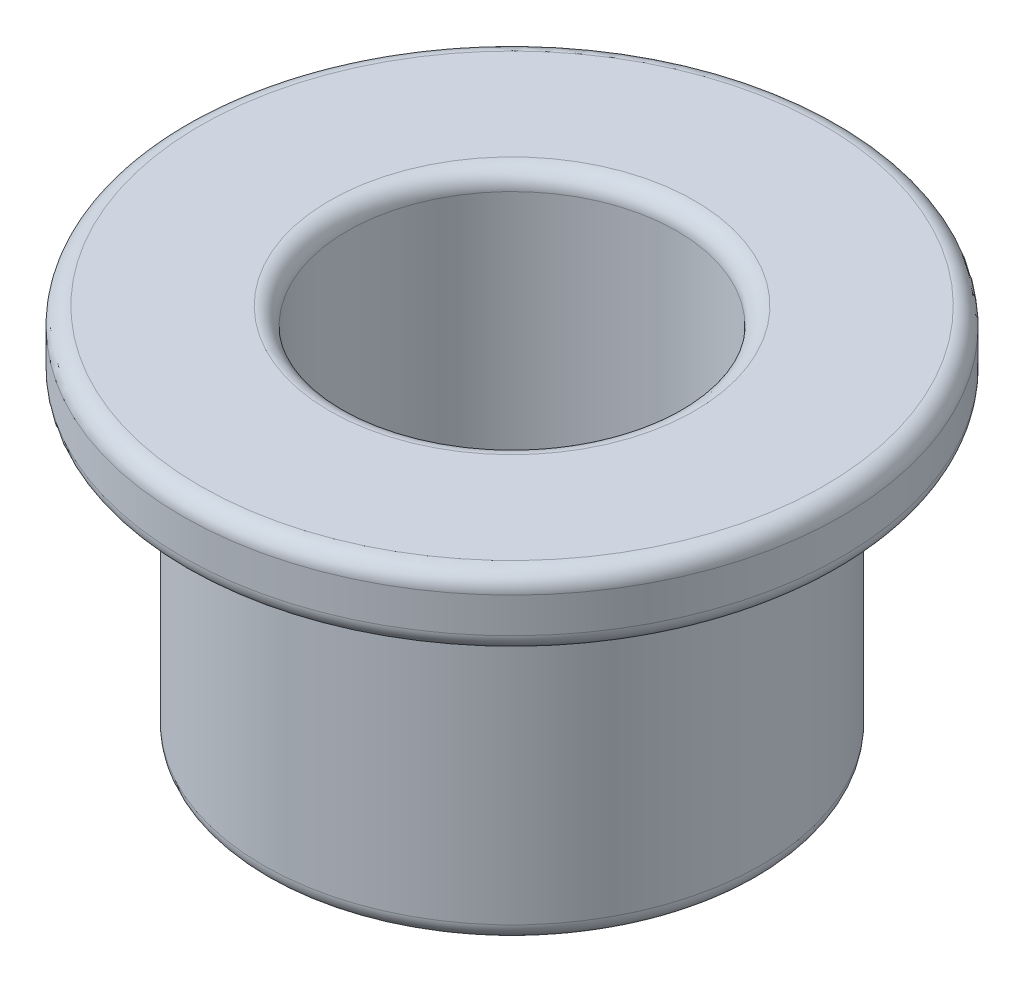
from build123d import *

# Parameters (mm, degrees)
SKETCH1_R          = 3.5941
EXTRUDE1_DEPTH     = 4.445
SKETCH2_R          = 4.7625
EXTRUDE2_DEPTH     = 1.016
SKETCH3_R          = 2.38125
CUT_EXTRUDE1_DEPTH = 9.67094767
FILLET1_R          = 0.254


with BuildPart() as part:
    # Sketch1 → Extrude1 (new body)
    with BuildSketch(Plane(origin=(0, 0, 0), x_dir=(1, 0, 0), z_dir=(0, 1, 0))):
        with Locations(Location((0, 0, 0), (0, 0, 270))):
            Circle(SKETCH1_R)
    extrude(amount=EXTRUDE1_DEPTH)

    # Sketch2 → Extrude2 (add)
    with BuildSketch(Plane(origin=(0, 4.445, 0), x_dir=(-1, 0, 0), z_dir=(0, 1, 0))):
        with Locations(Location((0, 0, 0), (0, 0, 90))):
            Circle(SKETCH2_R)
    extrude(amount=EXTRUDE2_DEPTH)

    # Sketch3 → Cut-Extrude1 (cut, through all)
    with BuildSketch(Plane(origin=(0, 5.461, 0), x_dir=(-1, 0, 0), z_dir=(0, 1, 0))):
        with Locations(Location((0, 0, 0), (0, 0, 90))):
            Circle(SKETCH3_R)
    extrude(amount=-CUT_EXTRUDE1_DEPTH, mode=Mode.SUBTRACT)

    # Fillet1
    fillet1_edges = [part.edges().sort_by_distance(p)[0] for p in [
        (0, 0, -2.38125),
        (0, 5.461, -2.38125),
        (0, 0, -3.5941),
        (0, 4.445, -3.5941),
        (0, 4.445, -4.7625),
        (0, 5.461, -4.7625),
    ]]
    fillet(fillet1_edges, radius=FILLET1_R)


solid = part.part
